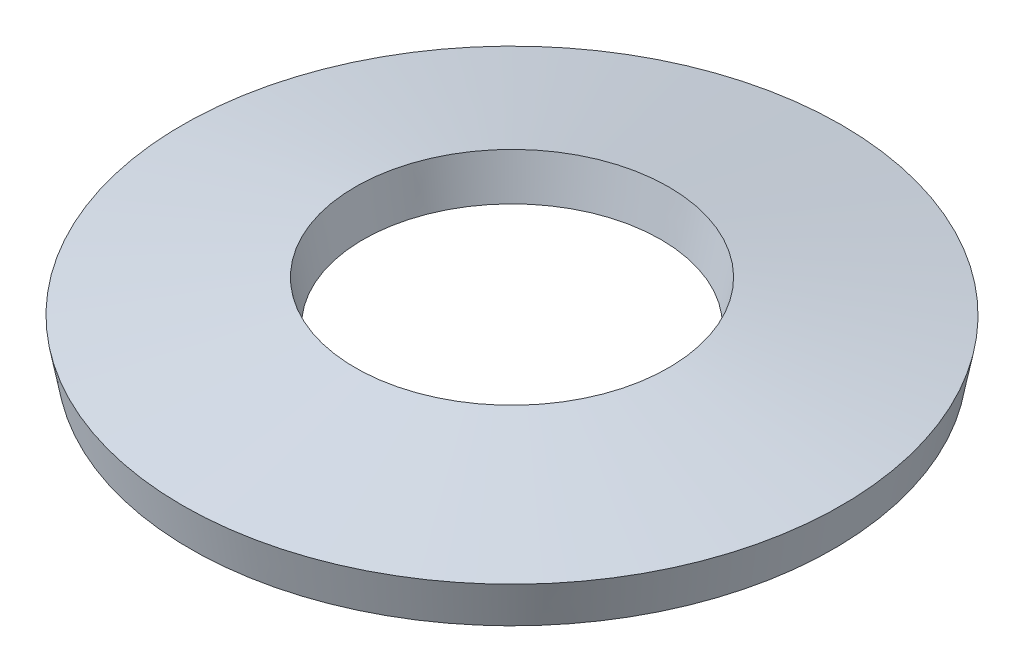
ISO-10303-21;
HEADER;
FILE_DESCRIPTION(('STEP AP214'),'2;1');
FILE_NAME('part.step','',(''),(''),'','','');
FILE_SCHEMA(('AUTOMOTIVE_DESIGN { 1 0 10303 214 1 1 1 1 }'));
ENDSEC;
DATA;
#1=APPLICATION_CONTEXT('core data for automotive mechanical design processes');
#2=APPLICATION_PROTOCOL_DEFINITION('international standard','automotive_design',2000,#1);
#3=PRODUCT_CONTEXT('',#1,'mechanical');
#4=PRODUCT('Part','Part','',(#3));
#5=PRODUCT_RELATED_PRODUCT_CATEGORY('part','',(#4));
#6=PRODUCT_DEFINITION_FORMATION('','',#4);
#7=PRODUCT_DEFINITION_CONTEXT('part definition',#1,'design');
#8=PRODUCT_DEFINITION('design','',#6,#7);
#9=PRODUCT_DEFINITION_SHAPE('','',#8);
#10=(LENGTH_UNIT() NAMED_UNIT(*) SI_UNIT(.MILLI.,.METRE.));
#11=(NAMED_UNIT(*) PLANE_ANGLE_UNIT() SI_UNIT($,.RADIAN.));
#12=(NAMED_UNIT(*) SI_UNIT($,.STERADIAN.) SOLID_ANGLE_UNIT());
#13=UNCERTAINTY_MEASURE_WITH_UNIT(LENGTH_MEASURE(1.E-05),#10,'distance_accuracy_value','');
#14=(GEOMETRIC_REPRESENTATION_CONTEXT(3) GLOBAL_UNCERTAINTY_ASSIGNED_CONTEXT((#13)) GLOBAL_UNIT_ASSIGNED_CONTEXT((#10,
#11,#12)) REPRESENTATION_CONTEXT('',''));
#15=CARTESIAN_POINT('',(0.,0.,0.));
#16=DIRECTION('',(0.,0.,1.));
#17=DIRECTION('',(1.,0.,0.));
#18=AXIS2_PLACEMENT_3D('',#15,#16,#17);
#19=CARTESIAN_POINT('',(0.,1.65099999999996,0.));
#20=DIRECTION('',(0.,1.,0.));
#21=DIRECTION('',(0.,0.,1.));
#22=AXIS2_PLACEMENT_3D('',#19,#20,#21);
#23=CONICAL_SURFACE('',#22,3.47717852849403,0.187496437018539);
#24=CARTESIAN_POINT('',(0.,0.727670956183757,0.));
#25=DIRECTION('',(0.,-1.,0.));
#26=DIRECTION('',(0.,0.,-1.));
#27=AXIS2_PLACEMENT_3D('',#24,#25,#26);
#28=CIRCLE('',#27,3.302);
#29=CARTESIAN_POINT('',(0.,0.727670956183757,-3.30200000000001));
#30=VERTEX_POINT('',#29);
#31=EDGE_CURVE('E44',#30,#30,#28,.T.);
#32=ORIENTED_EDGE('',*,*,#31,.T.);
#33=EDGE_LOOP('',(#32));
#34=FACE_BOUND('',#33,.T.);
#35=CARTESIAN_POINT('',(0.,1.65099999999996,0.));
#36=DIRECTION('',(0.,-1.,0.));
#37=DIRECTION('',(0.,0.,-1.));
#38=AXIS2_PLACEMENT_3D('',#35,#36,#37);
#39=CIRCLE('',#38,3.47717852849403);
#40=CARTESIAN_POINT('',(0.,1.65099999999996,-3.47717852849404));
#41=VERTEX_POINT('',#40);
#42=EDGE_CURVE('E10',#41,#41,#39,.T.);
#43=ORIENTED_EDGE('',*,*,#42,.F.);
#44=EDGE_LOOP('',(#43));
#45=FACE_BOUND('',#44,.T.);
#46=ADVANCED_FACE('F30',(#34,#45),#23,.F.);
#47=CARTESIAN_POINT('',(0.,0.923329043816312,0.));
#48=DIRECTION('',(0.,-1.,0.));
#49=DIRECTION('',(0.,0.,-1.));
#50=AXIS2_PLACEMENT_3D('',#47,#48,#49);
#51=CONICAL_SURFACE('',#50,7.31257852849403,1.38329988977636);
#52=ORIENTED_EDGE('',*,*,#42,.T.);
#53=EDGE_LOOP('',(#52));
#54=FACE_BOUND('',#53,.T.);
#55=CARTESIAN_POINT('',(0.,0.923329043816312,0.));
#56=DIRECTION('',(0.,-1.,0.));
#57=DIRECTION('',(0.,0.,-1.));
#58=AXIS2_PLACEMENT_3D('',#55,#56,#57);
#59=CIRCLE('',#58,7.31257852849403);
#60=CARTESIAN_POINT('',(0.,0.923329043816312,-7.31257852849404));
#61=VERTEX_POINT('',#60);
#62=EDGE_CURVE('E36',#61,#61,#59,.T.);
#63=ORIENTED_EDGE('',*,*,#62,.F.);
#64=EDGE_LOOP('',(#63));
#65=FACE_BOUND('',#64,.T.);
#66=ADVANCED_FACE('F60',(#54,#65),#51,.T.);
#67=CARTESIAN_POINT('',(0.,0.,0.));
#68=DIRECTION('',(0.,1.,0.));
#69=DIRECTION('',(0.,0.,1.));
#70=AXIS2_PLACEMENT_3D('',#67,#68,#69);
#71=CONICAL_SURFACE('',#70,7.1374,0.187496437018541);
#72=ORIENTED_EDGE('',*,*,#62,.T.);
#73=EDGE_LOOP('',(#72));
#74=FACE_BOUND('',#73,.T.);
#75=CARTESIAN_POINT('',(0.,0.,0.));
#76=DIRECTION('',(0.,-1.,0.));
#77=DIRECTION('',(0.,0.,-1.));
#78=AXIS2_PLACEMENT_3D('',#75,#76,#77);
#79=CIRCLE('',#78,7.1374);
#80=CARTESIAN_POINT('',(0.,0.,-7.13740000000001));
#81=VERTEX_POINT('',#80);
#82=EDGE_CURVE('E40',#81,#81,#79,.T.);
#83=ORIENTED_EDGE('',*,*,#82,.F.);
#84=EDGE_LOOP('',(#83));
#85=FACE_BOUND('',#84,.T.);
#86=ADVANCED_FACE('F54',(#74,#85),#71,.T.);
#87=CARTESIAN_POINT('',(0.,0.727670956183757,0.));
#88=DIRECTION('',(0.,-1.,0.));
#89=DIRECTION('',(0.,0.,-1.));
#90=AXIS2_PLACEMENT_3D('',#87,#88,#89);
#91=CONICAL_SURFACE('',#90,3.302,1.38329988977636);
#92=ORIENTED_EDGE('',*,*,#82,.T.);
#93=EDGE_LOOP('',(#92));
#94=FACE_BOUND('',#93,.T.);
#95=ORIENTED_EDGE('',*,*,#31,.F.);
#96=EDGE_LOOP('',(#95));
#97=FACE_BOUND('',#96,.T.);
#98=ADVANCED_FACE('F52',(#94,#97),#91,.F.);
#99=CLOSED_SHELL('',(#46,#66,#86,#98));
#100=MANIFOLD_SOLID_BREP('B2',#99);
#101=ADVANCED_BREP_SHAPE_REPRESENTATION('',(#18,#100),#14);
#102=SHAPE_DEFINITION_REPRESENTATION(#9,#101);
ENDSEC;
END-ISO-10303-21;
